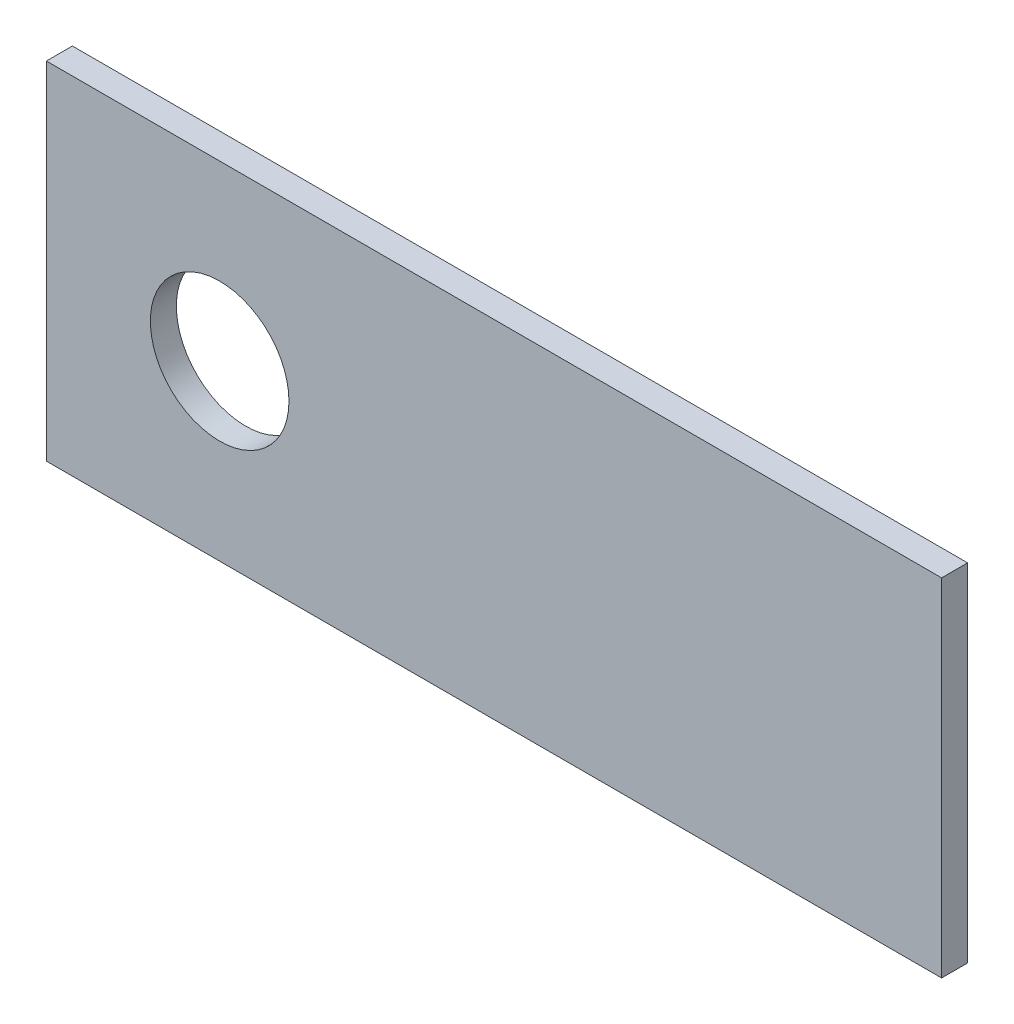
from build123d import *

# Parameters (mm, degrees)
SKETCH1_W           = 155
SKETCH1_H           = 60
BOSS_EXTRUDE1_DEPTH = 4.5
SKETCH2_R           = 12
CUT_EXTRUDE1_DEPTH  = 10


with BuildPart() as part:
    # Sketch1 → Boss-Extrude1 (new body)
    with BuildSketch(Plane.XY):
        Rectangle(SKETCH1_W, SKETCH1_H)
    extrude(amount=BOSS_EXTRUDE1_DEPTH)

    # Sketch2 → Cut-Extrude1 (cut)
    with BuildSketch(Plane.XY.offset(4.5)):
        with Locations((-47.5, 0)):
            Circle(SKETCH2_R)
    extrude(amount=-CUT_EXTRUDE1_DEPTH, mode=Mode.SUBTRACT)


solid = part.part
